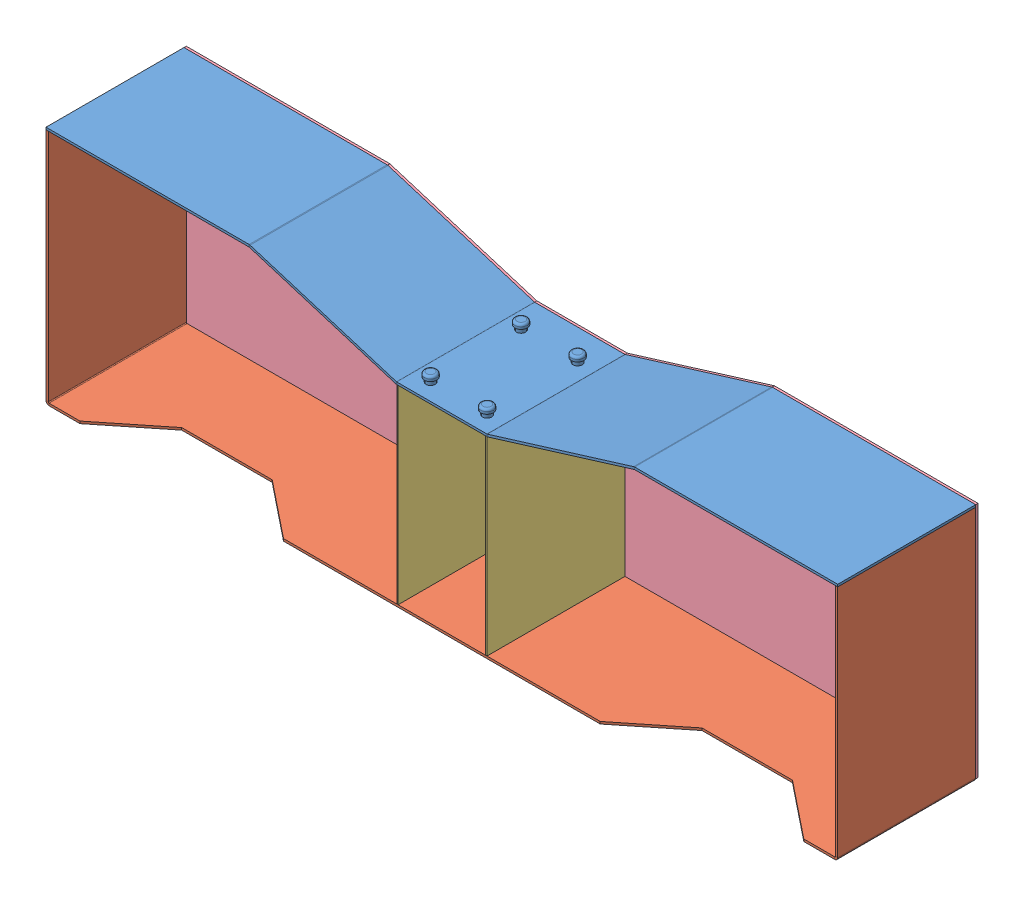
SolidWorks assembly BAC A GOUSSET.SLDASM, configuration Défaut (file format 4700). Lengths in mm.
Overall size (700 212 124).
5 component instances, 4 part files, 12 mates.
Components (placement in the parent):
- PAROIES ARRIERE DE BAC A GOUSSET-1: PAROIES ARRIERE DE BAC A GOUSSET.SLDPRT [Défaut] at (-332.5826 102.5035 -60) size (700 42 122)
- PAROIES AVANT DE BAC A GOUSSET-1: PAROIES AVANT DE BAC A GOUSSET.SLDPRT [Défaut] at (-332.5826 -109.4965 -60) size (700 210 122)
- SEPARATION POUR RISLAN-1: SEPARATION POUR RISLAN.SLDPRT [Défaut] at (57.3066 60.5035 -60) x (0 -1 0) z (-1 0 0) size (168 122 1.2)
- FOND DE BAC-1: FOND DE BAC.SLDPRT [Défaut] at (-332.5826 -107.4965 -62) size (700 210 2)
- SEPARATION POUR RISLAN-2: SEPARATION POUR RISLAN.SLDPRT [Défaut] at (-22.4719 60.5035 62) x (0 -1 0) z (1 0 0) size (168 122 1.2)
Mates (geometry in assembly coordinates):
- Coïncidente1: coincident anti-aligned: plane of PAROIES ARRIERE DE BAC A GOUSSET-1 through (-22.5826 60.5035 62) normal (0 -1 0); plane of SEPARATION POUR RISLAN-1 through (56.1066 60.5035 62) normal (0 1 0)
- Coïncidente2: coincident anti-aligned: plane of PAROIES ARRIERE DE BAC A GOUSSET-1 through (-22.5826 60.5035 62) normal (0 -1 0); plane of SEPARATION POUR RISLAN-2 through (-21.2719 60.5035 -60) normal (0 1 0)
- Coïncidente3: coincident aligned: line of PAROIES ARRIERE DE BAC A GOUSSET-1 through (57.3066 60.5035 62) axis (0 0 -1); line of SEPARATION POUR RISLAN-1 through (57.3066 60.5035 62) axis (0 0 -1)
- Coïncidente4: coincident aligned: plane of PAROIES ARRIERE DE BAC A GOUSSET-1 through (-23.2767 60.6245 62) normal (0 0 1); plane of SEPARATION POUR RISLAN-1 through (56.1066 -107.4965 62) normal (0 0 1)
- Coïncidente5: coincident aligned: plane of PAROIES ARRIERE DE BAC A GOUSSET-1 through (-23.2767 60.6245 62) normal (0 0 1); plane of SEPARATION POUR RISLAN-2 through (-21.2719 -107.4965 62) normal (0 0 1)
- Coïncidente6: coincident anti-aligned: line of PAROIES ARRIERE DE BAC A GOUSSET-1 through (-22.4719 60.5035 62) axis (0 0 -1); line of SEPARATION POUR RISLAN-2 through (-22.4719 60.5035 -60) axis (0 0 1)
- Coïncidente7: coincident aligned: plane of PAROIES ARRIERE DE BAC A GOUSSET-1 through (-332.5826 102.5035 62) normal (0 1 0); plane of FOND DE BAC-1 through (-152.5826 102.5035 -60) normal (0 1 0)
- Coïncidente8: coincident anti-aligned: plane of PAROIES ARRIERE DE BAC A GOUSSET-1 through (-152.7775 100.4709 -60) normal (0 0 -1); plane of FOND DE BAC-1 through (-332.5826 -107.4965 -60) normal (0 0 1)
- Coïncidente10: coincident aligned: plane of PAROIES ARRIERE DE BAC A GOUSSET-1 through (-332.5826 100.5035 62) normal (-1 0 0); plane of FOND DE BAC-1 through (-332.5826 102.5035 -60) normal (-1 0 0)
- Coïncidente11: coincident aligned: plane of PAROIES AVANT DE BAC A GOUSSET-1 through (-332.5826 100.5035 62) normal (-1 0 0); plane of FOND DE BAC-1 through (-332.5826 102.5035 -60) normal (-1 0 0)
- Coïncidente12: coincident anti-aligned: plane of PAROIES ARRIERE DE BAC A GOUSSET-1 through (-332.5826 100.5035 62) normal (0 -1 0); plane of PAROIES AVANT DE BAC A GOUSSET-1 through (-332.5826 100.5035 62) normal (0 1 0)
- Coïncidente13: coincident aligned: plane of PAROIES ARRIERE DE BAC A GOUSSET-1 through (187.8289 99.7669 62) normal (0 0 1); plane of PAROIES AVANT DE BAC A GOUSSET-1 through (-329.846 -107.4965 62) normal (0 0 1)
